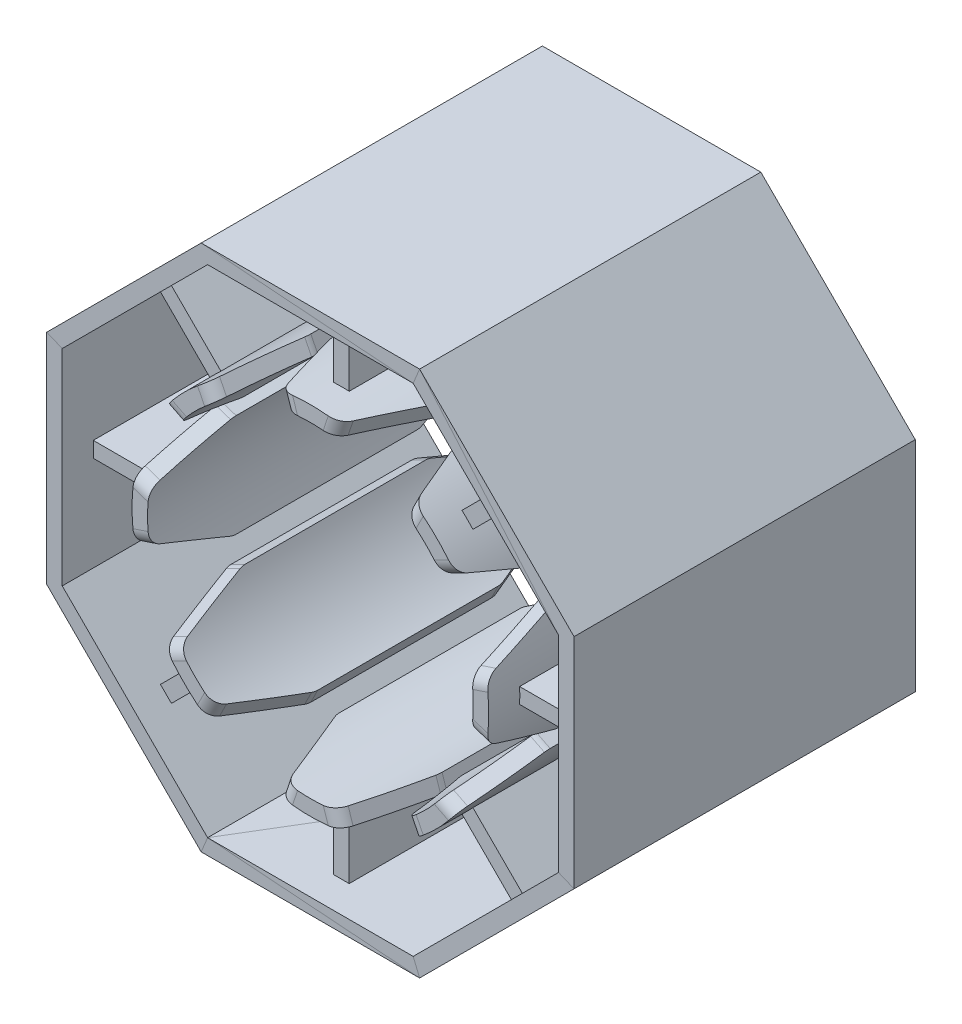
from build123d import *
from OCP.BRepFilletAPI import BRepFilletAPI_MakeChamfer

# Parameters (mm, degrees)
BOSS_EXTRUDE1_DEPTH = 22
BOSS_EXTRUDE2_DEPTH = 22
SKETCH4_W           = 1
SKETCH4_H           = 18
BOSS_EXTRUDE3_DEPTH = 5
CHAMFER1_SIZE       = 5
CHAMFER1_SIZE2      = 1.819851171
FILLET2_R           = 1
CIRPATTERN5_COUNT   = 8


with BuildPart() as part:
    # Sketch2 → Boss-Extrude1 (new body)
    with BuildSketch(Plane.XY):
        Polygon((7.04163056, -17), (17, -7.04163056), (17, 7.04163056), (7.04163056, 17), (-7.04163056, 17), (-17, 7.04163056), (-17, -7.04163056), (-7.04163056, -17), align=None)
        Polygon((16, -6.627416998), (16, 6.627416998), (6.627416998, 16), (-6.627416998, 16), (-16, 6.627416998), (-16, -6.627416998), (-6.627416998, -16), (6.627416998, -16), align=None, mode=Mode.SUBTRACT)
    extrude(amount=BOSS_EXTRUDE1_DEPTH)



with BuildPart() as body_2:
    # Sketch3 → Boss-Extrude2 (new body)
    with BuildSketch(Plane.XY.offset(22)):
        with BuildLine():
            Line((-3.630717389, 10.911823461), (-3.315002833, 9.962969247))
            ThreePointArc((-3.315002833, 9.962969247), (0, 10.5), (3.315002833, 9.962969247))
            Line((3.315002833, 9.962969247), (3.630717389, 10.911823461))
            ThreePointArc((3.630717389, 10.911823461), (0, 11.5), (-3.630717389, 10.911823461))
        make_face()
    extrude(amount=-BOSS_EXTRUDE2_DEPTH)


with BuildPart() as part_1:
    add(part.part)

    add(body_2.part)  # Boss-Extrude3 merges body 2
    # Sketch4 → Boss-Extrude3 (add)
    with BuildSketch(Plane.XZ.offset(-16)):
        with Locations((0, 11)):
            Rectangle(SKETCH4_W, SKETCH4_H)
    extrude(amount=BOSS_EXTRUDE3_DEPTH)

    # Chamfer1: one chamfer whose edges measure the first distance from different faces: ONE call of the kernel's chamfer builder (chamfer() names one face for all edges)
    chamfer1_edges_1 = [part_1.edges().sort_by_distance(p)[0] for p in [
        (-3.472860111, 10.437396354, 22),
        (-3.472860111, 10.437396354, 0),
    ]]
    chamfer1_side_1 = [part_1.faces().sort_by_distance(p)[0] for p in [
        (-3.472860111, 10.437396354, 11),
    ]]
    chamfer1_edges_2 = [part_1.edges().sort_by_distance(p)[0] for p in [
        (3.472860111, 10.437396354, 22),
        (3.472860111, 10.437396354, 0),
    ]]
    chamfer1_side_2 = [part_1.faces().sort_by_distance(p)[0] for p in [
        (3.472860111, 10.437396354, 11),
    ]]
    chamfer1 = BRepFilletAPI_MakeChamfer(part_1.part.solid().wrapped)
    for e in chamfer1_edges_1:
        chamfer1.Add(CHAMFER1_SIZE, CHAMFER1_SIZE2, e.wrapped, chamfer1_side_1[0].wrapped)  # the first distance lies on this face
    for e in chamfer1_edges_2:
        chamfer1.Add(CHAMFER1_SIZE, CHAMFER1_SIZE2, e.wrapped, chamfer1_side_2[0].wrapped)  # the first distance lies on this face
    add(Compound.cast(chamfer1.Shape()), mode=Mode.REPLACE)

    # Fillet2
    fillet2_edges = [part_1.edges().sort_by_distance(p)[0] for p in [
        (-3.472860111, 10.437396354, 5),
        (-1.698126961, 10.867810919, 0),
        (1.698126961, 10.867810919, 0),
        (3.472860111, 10.437396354, 5),
        (3.472860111, 10.437396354, 17),
        (-3.472860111, 10.437396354, 17),
        (1.698126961, 10.867810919, 22),
        (-1.698126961, 10.867810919, 22),
    ]]
    fillet(fillet2_edges, radius=FILLET2_R)


with BuildPart() as cirpattern5_1:
    # CirPattern5: pattern copy
    add(part_1.part.rotate(Axis((0, 0, 0), (0, 0, 1)), 1 * 360 / CIRPATTERN5_COUNT))


with BuildPart() as cirpattern5_2:
    # CirPattern5: pattern copy
    add(part_1.part.rotate(Axis((0, 0, 0), (0, 0, 1)), 2 * 360 / CIRPATTERN5_COUNT))


with BuildPart() as cirpattern5_3:
    # CirPattern5: pattern copy
    add(part_1.part.rotate(Axis((0, 0, 0), (0, 0, 1)), 3 * 360 / CIRPATTERN5_COUNT))


with BuildPart() as cirpattern5_4:
    # CirPattern5: pattern copy
    add(part_1.part.rotate(Axis((0, 0, 0), (0, 0, 1)), 4 * 360 / CIRPATTERN5_COUNT))


with BuildPart() as cirpattern5_5:
    # CirPattern5: pattern copy
    add(part_1.part.rotate(Axis((0, 0, 0), (0, 0, 1)), 5 * 360 / CIRPATTERN5_COUNT))


with BuildPart() as cirpattern5_6:
    # CirPattern5: pattern copy
    add(part_1.part.rotate(Axis((0, 0, 0), (0, 0, 1)), 6 * 360 / CIRPATTERN5_COUNT))


with BuildPart() as cirpattern5_7:
    # CirPattern5: pattern copy
    add(part_1.part.rotate(Axis((0, 0, 0), (0, 0, 1)), 7 * 360 / CIRPATTERN5_COUNT))


solid = Compound([part_1.part, cirpattern5_1.part, cirpattern5_2.part, cirpattern5_3.part, cirpattern5_4.part, cirpattern5_5.part, cirpattern5_6.part, cirpattern5_7.part])
